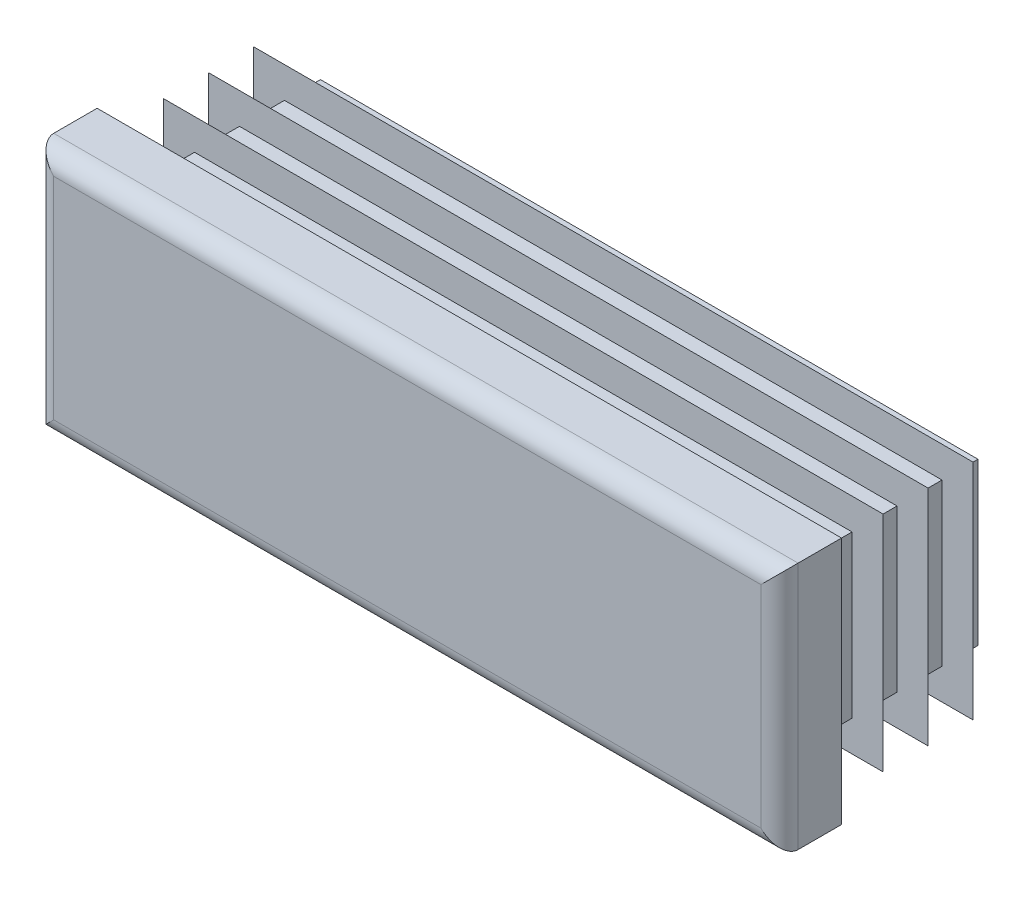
ISO-10303-21;
HEADER;
FILE_DESCRIPTION(('STEP AP214'),'2;1');
FILE_NAME('part.step','',(''),(''),'','','');
FILE_SCHEMA(('AUTOMOTIVE_DESIGN { 1 0 10303 214 1 1 1 1 }'));
ENDSEC;
DATA;
#1=APPLICATION_CONTEXT('core data for automotive mechanical design processes');
#2=APPLICATION_PROTOCOL_DEFINITION('international standard','automotive_design',2000,#1);
#3=PRODUCT_CONTEXT('',#1,'mechanical');
#4=PRODUCT('Part','Part','',(#3));
#5=PRODUCT_RELATED_PRODUCT_CATEGORY('part','',(#4));
#6=PRODUCT_DEFINITION_FORMATION('','',#4);
#7=PRODUCT_DEFINITION_CONTEXT('part definition',#1,'design');
#8=PRODUCT_DEFINITION('design','',#6,#7);
#9=PRODUCT_DEFINITION_SHAPE('','',#8);
#10=(LENGTH_UNIT() NAMED_UNIT(*) SI_UNIT(.MILLI.,.METRE.));
#11=(NAMED_UNIT(*) PLANE_ANGLE_UNIT() SI_UNIT($,.RADIAN.));
#12=(NAMED_UNIT(*) SI_UNIT($,.STERADIAN.) SOLID_ANGLE_UNIT());
#13=UNCERTAINTY_MEASURE_WITH_UNIT(LENGTH_MEASURE(1.E-05),#10,'distance_accuracy_value','');
#14=(GEOMETRIC_REPRESENTATION_CONTEXT(3) GLOBAL_UNCERTAINTY_ASSIGNED_CONTEXT((#13)) GLOBAL_UNIT_ASSIGNED_CONTEXT((#10,
#11,#12)) REPRESENTATION_CONTEXT('',''));
#15=CARTESIAN_POINT('',(0.,0.,0.));
#16=DIRECTION('',(0.,0.,1.));
#17=DIRECTION('',(1.,0.,0.));
#18=AXIS2_PLACEMENT_3D('',#15,#16,#17);
#19=CARTESIAN_POINT('',(28.5,-10.,5.));
#20=DIRECTION('',(0.,0.,-1.));
#21=DIRECTION('',(0.,1.,0.));
#22=AXIS2_PLACEMENT_3D('',#19,#20,#21);
#23=PLANE('',#22);
#24=DIRECTION('',(0.,1.,0.));
#25=VECTOR('',#24,1.);
#26=CARTESIAN_POINT('',(-28.5,-10.,5.));
#27=LINE('',#26,#25);
#28=CARTESIAN_POINT('',(-28.5,-8.5,5.));
#29=VERTEX_POINT('',#28);
#30=CARTESIAN_POINT('',(-28.5,8.5,5.));
#31=VERTEX_POINT('',#30);
#32=EDGE_CURVE('E310',#29,#31,#27,.T.);
#33=ORIENTED_EDGE('',*,*,#32,.F.);
#34=DIRECTION('',(-1.,0.,0.));
#35=VECTOR('',#34,1.);
#36=CARTESIAN_POINT('',(30.,-8.5,5.));
#37=LINE('',#36,#35);
#38=CARTESIAN_POINT('',(28.5,-8.5,5.));
#39=VERTEX_POINT('',#38);
#40=EDGE_CURVE('E482',#39,#29,#37,.T.);
#41=ORIENTED_EDGE('',*,*,#40,.F.);
#42=DIRECTION('',(0.,1.,0.));
#43=VECTOR('',#42,1.);
#44=CARTESIAN_POINT('',(28.5,-10.,5.));
#45=LINE('',#44,#43);
#46=CARTESIAN_POINT('',(28.5,8.5,5.));
#47=VERTEX_POINT('',#46);
#48=EDGE_CURVE('E305',#39,#47,#45,.T.);
#49=ORIENTED_EDGE('',*,*,#48,.T.);
#50=DIRECTION('',(-1.,0.,0.));
#51=VECTOR('',#50,1.);
#52=CARTESIAN_POINT('',(30.,8.5,5.));
#53=LINE('',#52,#51);
#54=EDGE_CURVE('E630',#47,#31,#53,.T.);
#55=ORIENTED_EDGE('',*,*,#54,.T.);
#56=EDGE_LOOP('',(#33,#41,#49,#55));
#57=FACE_BOUND('',#56,.T.);
#58=ADVANCED_FACE('F14',(#57),#23,.F.);
#59=CARTESIAN_POINT('',(-28.5,-10.,3.5));
#60=DIRECTION('',(0.,1.,0.));
#61=DIRECTION('',(-1.,0.,0.));
#62=AXIS2_PLACEMENT_3D('',#59,#60,#61);
#63=CYLINDRICAL_SURFACE('',#62,1.5);
#64=DIRECTION('',(0.,1.,0.));
#65=VECTOR('',#64,1.);
#66=CARTESIAN_POINT('',(-30.,-10.,3.5));
#67=LINE('',#66,#65);
#68=CARTESIAN_POINT('',(-30.,-10.,3.5));
#69=VERTEX_POINT('',#68);
#70=CARTESIAN_POINT('',(-30.,10.,3.5));
#71=VERTEX_POINT('',#70);
#72=EDGE_CURVE('E402',#69,#71,#67,.T.);
#73=ORIENTED_EDGE('',*,*,#72,.F.);
#74=CARTESIAN_POINT('',(-28.5,-8.5,3.5));
#75=DIRECTION('',(-0.707106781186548,0.707106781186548,0.));
#76=DIRECTION('',(0.707106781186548,0.707106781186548,0.));
#77=AXIS2_PLACEMENT_3D('',#74,#75,#76);
#78=ELLIPSE('',#77,2.12132034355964,1.5);
#79=EDGE_CURVE('E59',#69,#29,#78,.T.);
#80=ORIENTED_EDGE('',*,*,#79,.T.);
#81=ORIENTED_EDGE('',*,*,#32,.T.);
#82=CARTESIAN_POINT('',(-28.5,8.5,3.5));
#83=DIRECTION('',(0.707106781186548,0.707106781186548,0.));
#84=DIRECTION('',(-0.707106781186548,0.707106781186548,0.));
#85=AXIS2_PLACEMENT_3D('',#82,#83,#84);
#86=ELLIPSE('',#85,2.12132034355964,1.5);
#87=EDGE_CURVE('E306',#31,#71,#86,.F.);
#88=ORIENTED_EDGE('',*,*,#87,.T.);
#89=EDGE_LOOP('',(#73,#80,#81,#88));
#90=FACE_BOUND('',#89,.T.);
#91=ADVANCED_FACE('F16',(#90),#63,.T.);
#92=CARTESIAN_POINT('',(-30.,-10.,3.5));
#93=DIRECTION('',(1.,0.,0.));
#94=DIRECTION('',(0.,1.,0.));
#95=AXIS2_PLACEMENT_3D('',#92,#93,#94);
#96=PLANE('',#95);
#97=DIRECTION('',(0.,0.,-1.));
#98=VECTOR('',#97,1.);
#99=CARTESIAN_POINT('',(-30.,10.,3.5));
#100=LINE('',#99,#98);
#101=CARTESIAN_POINT('',(-30.,10.,0.));
#102=VERTEX_POINT('',#101);
#103=EDGE_CURVE('E615',#71,#102,#100,.T.);
#104=ORIENTED_EDGE('',*,*,#103,.T.);
#105=DIRECTION('',(0.,1.,0.));
#106=VECTOR('',#105,1.);
#107=CARTESIAN_POINT('',(-30.,-10.,0.));
#108=LINE('',#107,#106);
#109=CARTESIAN_POINT('',(-30.,-10.,0.));
#110=VERTEX_POINT('',#109);
#111=EDGE_CURVE('E400',#110,#102,#108,.T.);
#112=ORIENTED_EDGE('',*,*,#111,.F.);
#113=DIRECTION('',(0.,0.,-1.));
#114=VECTOR('',#113,1.);
#115=CARTESIAN_POINT('',(-30.,-10.,3.5));
#116=LINE('',#115,#114);
#117=EDGE_CURVE('E616',#69,#110,#116,.T.);
#118=ORIENTED_EDGE('',*,*,#117,.F.);
#119=ORIENTED_EDGE('',*,*,#72,.T.);
#120=EDGE_LOOP('',(#104,#112,#118,#119));
#121=FACE_BOUND('',#120,.T.);
#122=ADVANCED_FACE('F697',(#121),#96,.F.);
#123=CARTESIAN_POINT('',(-26.5,-10.,0.));
#124=DIRECTION('',(1.,0.,0.));
#125=DIRECTION('',(0.,1.,0.));
#126=AXIS2_PLACEMENT_3D('',#123,#124,#125);
#127=PLANE('',#126);
#128=DIRECTION('',(0.,1.,0.));
#129=VECTOR('',#128,1.);
#130=CARTESIAN_POINT('',(-26.5,-10.,0.));
#131=LINE('',#130,#129);
#132=CARTESIAN_POINT('',(-26.5,-6.5,0.));
#133=VERTEX_POINT('',#132);
#134=CARTESIAN_POINT('',(-26.5,6.5,0.));
#135=VERTEX_POINT('',#134);
#136=EDGE_CURVE('E397',#133,#135,#131,.T.);
#137=ORIENTED_EDGE('',*,*,#136,.T.);
#138=DIRECTION('',(0.,0.,-1.));
#139=VECTOR('',#138,1.);
#140=CARTESIAN_POINT('',(-26.5,6.5,0.));
#141=LINE('',#140,#139);
#142=CARTESIAN_POINT('',(-26.5,6.5,-0.725));
#143=VERTEX_POINT('',#142);
#144=EDGE_CURVE('E495',#135,#143,#141,.T.);
#145=ORIENTED_EDGE('',*,*,#144,.T.);
#146=DIRECTION('',(0.,1.,0.));
#147=VECTOR('',#146,1.);
#148=CARTESIAN_POINT('',(-26.5,-10.,-0.725));
#149=LINE('',#148,#147);
#150=CARTESIAN_POINT('',(-26.5,-6.5,-0.725));
#151=VERTEX_POINT('',#150);
#152=EDGE_CURVE('E394',#151,#143,#149,.T.);
#153=ORIENTED_EDGE('',*,*,#152,.F.);
#154=DIRECTION('',(0.,0.,1.));
#155=VECTOR('',#154,1.);
#156=CARTESIAN_POINT('',(-26.5,-6.5,0.));
#157=LINE('',#156,#155);
#158=EDGE_CURVE('E489',#151,#133,#157,.T.);
#159=ORIENTED_EDGE('',*,*,#158,.T.);
#160=EDGE_LOOP('',(#137,#145,#153,#159));
#161=FACE_BOUND('',#160,.T.);
#162=ADVANCED_FACE('F787',(#161),#127,.F.);
#163=CARTESIAN_POINT('',(-29.,-10.,-0.725));
#164=DIRECTION('',(0.34202014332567,0.,0.939692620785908));
#165=DIRECTION('',(-0.939692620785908,0.,0.34202014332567));
#166=AXIS2_PLACEMENT_3D('',#163,#164,#165);
#167=PLANE('',#166);
#168=DIRECTION('',(0.,1.,0.));
#169=VECTOR('',#168,1.);
#170=CARTESIAN_POINT('',(-29.,-10.,-0.725));
#171=LINE('',#170,#169);
#172=CARTESIAN_POINT('',(-29.,-9.,-0.725));
#173=VERTEX_POINT('',#172);
#174=CARTESIAN_POINT('',(-29.,9.,-0.725));
#175=VERTEX_POINT('',#174);
#176=EDGE_CURVE('E392',#173,#175,#171,.T.);
#177=ORIENTED_EDGE('',*,*,#176,.T.);
#178=DIRECTION('',(0.844349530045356,-0.438895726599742,-0.307318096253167));
#179=VECTOR('',#178,1.);
#180=CARTESIAN_POINT('',(-21.9589533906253,5.3400402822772,-3.28773138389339));
#181=LINE('',#180,#179);
#182=CARTESIAN_POINT('',(-26.5,7.70049158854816,-1.63492558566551));
#183=VERTEX_POINT('',#182);
#184=EDGE_CURVE('E519',#175,#183,#181,.T.);
#185=ORIENTED_EDGE('',*,*,#184,.T.);
#186=DIRECTION('',(0.,1.,0.));
#187=VECTOR('',#186,1.);
#188=CARTESIAN_POINT('',(-26.5,-10.,-1.63492558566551));
#189=LINE('',#188,#187);
#190=CARTESIAN_POINT('',(-26.5,-7.70049158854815,-1.63492558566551));
#191=VERTEX_POINT('',#190);
#192=EDGE_CURVE('E389',#191,#183,#189,.T.);
#193=ORIENTED_EDGE('',*,*,#192,.F.);
#194=DIRECTION('',(-0.844349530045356,-0.438895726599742,0.307318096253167));
#195=VECTOR('',#194,1.);
#196=CARTESIAN_POINT('',(-29.3705814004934,-9.19262945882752,-0.590119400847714));
#197=LINE('',#196,#195);
#198=EDGE_CURVE('E507',#191,#173,#197,.T.);
#199=ORIENTED_EDGE('',*,*,#198,.T.);
#200=EDGE_LOOP('',(#177,#185,#193,#199));
#201=FACE_BOUND('',#200,.T.);
#202=ADVANCED_FACE('F783',(#201),#167,.F.);
#203=CARTESIAN_POINT('',(-26.5,-10.,-1.63492558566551));
#204=DIRECTION('',(1.,0.,0.));
#205=DIRECTION('',(0.,1.,0.));
#206=AXIS2_PLACEMENT_3D('',#203,#204,#205);
#207=PLANE('',#206);
#208=ORIENTED_EDGE('',*,*,#192,.T.);
#209=DIRECTION('',(0.,-0.819152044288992,-0.573576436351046));
#210=VECTOR('',#209,1.);
#211=CARTESIAN_POINT('',(-26.5,-4.17671654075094,-9.95143625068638));
#212=LINE('',#211,#210);
#213=CARTESIAN_POINT('',(-26.5,6.5,-2.47551884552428));
#214=VERTEX_POINT('',#213);
#215=EDGE_CURVE('E516',#183,#214,#212,.T.);
#216=ORIENTED_EDGE('',*,*,#215,.T.);
#217=DIRECTION('',(0.,0.,-1.));
#218=VECTOR('',#217,1.);
#219=CARTESIAN_POINT('',(-26.5,6.5,-1.63492558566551));
#220=LINE('',#219,#218);
#221=CARTESIAN_POINT('',(-26.5,6.5,-4.35));
#222=VERTEX_POINT('',#221);
#223=EDGE_CURVE('E525',#214,#222,#220,.T.);
#224=ORIENTED_EDGE('',*,*,#223,.T.);
#225=DIRECTION('',(0.,1.,0.));
#226=VECTOR('',#225,1.);
#227=CARTESIAN_POINT('',(-26.5,-10.,-4.35));
#228=LINE('',#227,#226);
#229=CARTESIAN_POINT('',(-26.5,-6.5,-4.35));
#230=VERTEX_POINT('',#229);
#231=EDGE_CURVE('E386',#230,#222,#228,.T.);
#232=ORIENTED_EDGE('',*,*,#231,.F.);
#233=DIRECTION('',(0.,0.,1.));
#234=VECTOR('',#233,1.);
#235=CARTESIAN_POINT('',(-26.5,-6.5,-1.63492558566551));
#236=LINE('',#235,#234);
#237=CARTESIAN_POINT('',(-26.5,-6.5,-2.47551884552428));
#238=VERTEX_POINT('',#237);
#239=EDGE_CURVE('E522',#230,#238,#236,.T.);
#240=ORIENTED_EDGE('',*,*,#239,.T.);
#241=DIRECTION('',(0.,-0.819152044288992,0.573576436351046));
#242=VECTOR('',#241,1.);
#243=CARTESIAN_POINT('',(-26.5,-9.24348489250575,-0.554510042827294));
#244=LINE('',#243,#242);
#245=EDGE_CURVE('E504',#238,#191,#244,.T.);
#246=ORIENTED_EDGE('',*,*,#245,.T.);
#247=EDGE_LOOP('',(#208,#216,#224,#232,#240,#246));
#248=FACE_BOUND('',#247,.T.);
#249=ADVANCED_FACE('F779',(#248),#207,.F.);
#250=CARTESIAN_POINT('',(-29.,-10.,-4.35));
#251=DIRECTION('',(0.34202014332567,0.,0.939692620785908));
#252=DIRECTION('',(-0.939692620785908,0.,0.34202014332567));
#253=AXIS2_PLACEMENT_3D('',#250,#251,#252);
#254=PLANE('',#253);
#255=DIRECTION('',(0.,1.,0.));
#256=VECTOR('',#255,1.);
#257=CARTESIAN_POINT('',(-29.,-10.,-4.35));
#258=LINE('',#257,#256);
#259=CARTESIAN_POINT('',(-29.,-9.,-4.35));
#260=VERTEX_POINT('',#259);
#261=CARTESIAN_POINT('',(-29.,9.,-4.35));
#262=VERTEX_POINT('',#261);
#263=EDGE_CURVE('E384',#260,#262,#258,.T.);
#264=ORIENTED_EDGE('',*,*,#263,.T.);
#265=DIRECTION('',(0.844349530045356,-0.438895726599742,-0.307318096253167));
#266=VECTOR('',#265,1.);
#267=CARTESIAN_POINT('',(-21.9589533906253,5.3400402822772,-6.91273138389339));
#268=LINE('',#267,#266);
#269=CARTESIAN_POINT('',(-26.5,7.70049158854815,-5.25992558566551));
#270=VERTEX_POINT('',#269);
#271=EDGE_CURVE('E549',#262,#270,#268,.T.);
#272=ORIENTED_EDGE('',*,*,#271,.T.);
#273=DIRECTION('',(0.,1.,0.));
#274=VECTOR('',#273,1.);
#275=CARTESIAN_POINT('',(-26.5,-10.,-5.25992558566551));
#276=LINE('',#275,#274);
#277=CARTESIAN_POINT('',(-26.5,-7.70049158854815,-5.25992558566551));
#278=VERTEX_POINT('',#277);
#279=EDGE_CURVE('E381',#278,#270,#276,.T.);
#280=ORIENTED_EDGE('',*,*,#279,.F.);
#281=DIRECTION('',(-0.844349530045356,-0.438895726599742,0.307318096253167));
#282=VECTOR('',#281,1.);
#283=CARTESIAN_POINT('',(-29.3705814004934,-9.19262945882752,-4.21511940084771));
#284=LINE('',#283,#282);
#285=EDGE_CURVE('E537',#278,#260,#284,.T.);
#286=ORIENTED_EDGE('',*,*,#285,.T.);
#287=EDGE_LOOP('',(#264,#272,#280,#286));
#288=FACE_BOUND('',#287,.T.);
#289=ADVANCED_FACE('F775',(#288),#254,.F.);
#290=CARTESIAN_POINT('',(-26.5,-10.,-5.25992558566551));
#291=DIRECTION('',(1.,0.,0.));
#292=DIRECTION('',(0.,1.,0.));
#293=AXIS2_PLACEMENT_3D('',#290,#291,#292);
#294=PLANE('',#293);
#295=ORIENTED_EDGE('',*,*,#279,.T.);
#296=DIRECTION('',(0.,-0.819152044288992,-0.573576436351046));
#297=VECTOR('',#296,1.);
#298=CARTESIAN_POINT('',(-26.5,-4.17671654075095,-13.5764362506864));
#299=LINE('',#298,#297);
#300=CARTESIAN_POINT('',(-26.5,6.5,-6.10051884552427));
#301=VERTEX_POINT('',#300);
#302=EDGE_CURVE('E546',#270,#301,#299,.T.);
#303=ORIENTED_EDGE('',*,*,#302,.T.);
#304=DIRECTION('',(0.,0.,-1.));
#305=VECTOR('',#304,1.);
#306=CARTESIAN_POINT('',(-26.5,6.5,-5.25992558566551));
#307=LINE('',#306,#305);
#308=CARTESIAN_POINT('',(-26.5,6.5,-7.975));
#309=VERTEX_POINT('',#308);
#310=EDGE_CURVE('E555',#301,#309,#307,.T.);
#311=ORIENTED_EDGE('',*,*,#310,.T.);
#312=DIRECTION('',(0.,1.,0.));
#313=VECTOR('',#312,1.);
#314=CARTESIAN_POINT('',(-26.5,-10.,-7.975));
#315=LINE('',#314,#313);
#316=CARTESIAN_POINT('',(-26.5,-6.5,-7.975));
#317=VERTEX_POINT('',#316);
#318=EDGE_CURVE('E378',#317,#309,#315,.T.);
#319=ORIENTED_EDGE('',*,*,#318,.F.);
#320=DIRECTION('',(0.,0.,1.));
#321=VECTOR('',#320,1.);
#322=CARTESIAN_POINT('',(-26.5,-6.5,-5.25992558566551));
#323=LINE('',#322,#321);
#324=CARTESIAN_POINT('',(-26.5,-6.5,-6.10051884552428));
#325=VERTEX_POINT('',#324);
#326=EDGE_CURVE('E552',#317,#325,#323,.T.);
#327=ORIENTED_EDGE('',*,*,#326,.T.);
#328=DIRECTION('',(0.,-0.819152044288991,0.573576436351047));
#329=VECTOR('',#328,1.);
#330=CARTESIAN_POINT('',(-26.5,-9.24348489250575,-4.17951004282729));
#331=LINE('',#330,#329);
#332=EDGE_CURVE('E534',#325,#278,#331,.T.);
#333=ORIENTED_EDGE('',*,*,#332,.T.);
#334=EDGE_LOOP('',(#295,#303,#311,#319,#327,#333));
#335=FACE_BOUND('',#334,.T.);
#336=ADVANCED_FACE('F771',(#335),#294,.F.);
#337=CARTESIAN_POINT('',(-29.,-10.,-7.975));
#338=DIRECTION('',(0.342020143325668,0.,0.939692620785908));
#339=DIRECTION('',(-0.939692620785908,0.,0.342020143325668));
#340=AXIS2_PLACEMENT_3D('',#337,#338,#339);
#341=PLANE('',#340);
#342=DIRECTION('',(0.,1.,0.));
#343=VECTOR('',#342,1.);
#344=CARTESIAN_POINT('',(-29.,-10.,-7.975));
#345=LINE('',#344,#343);
#346=CARTESIAN_POINT('',(-29.,-9.,-7.975));
#347=VERTEX_POINT('',#346);
#348=CARTESIAN_POINT('',(-29.,9.,-7.975));
#349=VERTEX_POINT('',#348);
#350=EDGE_CURVE('E376',#347,#349,#345,.T.);
#351=ORIENTED_EDGE('',*,*,#350,.T.);
#352=DIRECTION('',(0.844349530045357,-0.438895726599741,-0.307318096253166));
#353=VECTOR('',#352,1.);
#354=CARTESIAN_POINT('',(-21.9589533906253,5.34004028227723,-10.5377313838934));
#355=LINE('',#354,#353);
#356=CARTESIAN_POINT('',(-26.5,7.70049158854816,-8.88492558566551));
#357=VERTEX_POINT('',#356);
#358=EDGE_CURVE('E579',#349,#357,#355,.T.);
#359=ORIENTED_EDGE('',*,*,#358,.T.);
#360=DIRECTION('',(0.,1.,0.));
#361=VECTOR('',#360,1.);
#362=CARTESIAN_POINT('',(-26.5,-10.,-8.88492558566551));
#363=LINE('',#362,#361);
#364=CARTESIAN_POINT('',(-26.5,-7.70049158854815,-8.88492558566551));
#365=VERTEX_POINT('',#364);
#366=EDGE_CURVE('E373',#365,#357,#363,.T.);
#367=ORIENTED_EDGE('',*,*,#366,.F.);
#368=DIRECTION('',(-0.844349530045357,-0.438895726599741,0.307318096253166));
#369=VECTOR('',#368,1.);
#370=CARTESIAN_POINT('',(-29.3705814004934,-9.19262945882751,-7.84011940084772));
#371=LINE('',#370,#369);
#372=EDGE_CURVE('E567',#365,#347,#371,.T.);
#373=ORIENTED_EDGE('',*,*,#372,.T.);
#374=EDGE_LOOP('',(#351,#359,#367,#373));
#375=FACE_BOUND('',#374,.T.);
#376=ADVANCED_FACE('F767',(#375),#341,.F.);
#377=CARTESIAN_POINT('',(-26.5,-10.,-8.88492558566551));
#378=DIRECTION('',(1.,0.,0.));
#379=DIRECTION('',(0.,1.,0.));
#380=AXIS2_PLACEMENT_3D('',#377,#378,#379);
#381=PLANE('',#380);
#382=ORIENTED_EDGE('',*,*,#366,.T.);
#383=DIRECTION('',(0.,-0.819152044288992,-0.573576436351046));
#384=VECTOR('',#383,1.);
#385=CARTESIAN_POINT('',(-26.5,-4.17671654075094,-17.2014362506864));
#386=LINE('',#385,#384);
#387=CARTESIAN_POINT('',(-26.5,6.5,-9.72551884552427));
#388=VERTEX_POINT('',#387);
#389=EDGE_CURVE('E576',#357,#388,#386,.T.);
#390=ORIENTED_EDGE('',*,*,#389,.T.);
#391=DIRECTION('',(0.,0.,-1.));
#392=VECTOR('',#391,1.);
#393=CARTESIAN_POINT('',(-26.5,6.5,-8.88492558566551));
#394=LINE('',#393,#392);
#395=CARTESIAN_POINT('',(-26.5,6.5,-11.6));
#396=VERTEX_POINT('',#395);
#397=EDGE_CURVE('E585',#388,#396,#394,.T.);
#398=ORIENTED_EDGE('',*,*,#397,.T.);
#399=DIRECTION('',(0.,1.,0.));
#400=VECTOR('',#399,1.);
#401=CARTESIAN_POINT('',(-26.5,-10.,-11.6));
#402=LINE('',#401,#400);
#403=CARTESIAN_POINT('',(-26.5,-6.5,-11.6));
#404=VERTEX_POINT('',#403);
#405=EDGE_CURVE('E370',#404,#396,#402,.T.);
#406=ORIENTED_EDGE('',*,*,#405,.F.);
#407=DIRECTION('',(0.,0.,1.));
#408=VECTOR('',#407,1.);
#409=CARTESIAN_POINT('',(-26.5,-6.5,-8.88492558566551));
#410=LINE('',#409,#408);
#411=CARTESIAN_POINT('',(-26.5,-6.5,-9.72551884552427));
#412=VERTEX_POINT('',#411);
#413=EDGE_CURVE('E582',#404,#412,#410,.T.);
#414=ORIENTED_EDGE('',*,*,#413,.T.);
#415=DIRECTION('',(0.,-0.819152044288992,0.573576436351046));
#416=VECTOR('',#415,1.);
#417=CARTESIAN_POINT('',(-26.5,-9.24348489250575,-7.80451004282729));
#418=LINE('',#417,#416);
#419=EDGE_CURVE('E564',#412,#365,#418,.T.);
#420=ORIENTED_EDGE('',*,*,#419,.T.);
#421=EDGE_LOOP('',(#382,#390,#398,#406,#414,#420));
#422=FACE_BOUND('',#421,.T.);
#423=ADVANCED_FACE('F764',(#422),#381,.F.);
#424=CARTESIAN_POINT('',(-29.,-10.,-11.6));
#425=DIRECTION('',(0.342020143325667,0.,0.939692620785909));
#426=DIRECTION('',(-0.939692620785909,0.,0.342020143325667));
#427=AXIS2_PLACEMENT_3D('',#424,#425,#426);
#428=PLANE('',#427);
#429=DIRECTION('',(0.,1.,0.));
#430=VECTOR('',#429,1.);
#431=CARTESIAN_POINT('',(-29.,-10.,-11.6));
#432=LINE('',#431,#430);
#433=CARTESIAN_POINT('',(-29.,-9.,-11.6));
#434=VERTEX_POINT('',#433);
#435=CARTESIAN_POINT('',(-29.,9.,-11.6));
#436=VERTEX_POINT('',#435);
#437=EDGE_CURVE('E368',#434,#436,#432,.T.);
#438=ORIENTED_EDGE('',*,*,#437,.T.);
#439=DIRECTION('',(0.844349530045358,-0.438895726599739,-0.307318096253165));
#440=VECTOR('',#439,1.);
#441=CARTESIAN_POINT('',(-21.9589533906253,5.34004028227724,-14.1627313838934));
#442=LINE('',#441,#440);
#443=CARTESIAN_POINT('',(-26.5,7.70049158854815,-12.5099255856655));
#444=VERTEX_POINT('',#443);
#445=EDGE_CURVE('E607',#436,#444,#442,.T.);
#446=ORIENTED_EDGE('',*,*,#445,.T.);
#447=DIRECTION('',(0.,1.,0.));
#448=VECTOR('',#447,1.);
#449=CARTESIAN_POINT('',(-26.5,-10.,-12.5099255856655));
#450=LINE('',#449,#448);
#451=CARTESIAN_POINT('',(-26.5,-7.70049158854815,-12.5099255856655));
#452=VERTEX_POINT('',#451);
#453=EDGE_CURVE('E365',#452,#444,#450,.T.);
#454=ORIENTED_EDGE('',*,*,#453,.F.);
#455=DIRECTION('',(-0.844349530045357,-0.43889572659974,0.307318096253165));
#456=VECTOR('',#455,1.);
#457=CARTESIAN_POINT('',(-29.3705814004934,-9.19262945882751,-11.4651194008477));
#458=LINE('',#457,#456);
#459=EDGE_CURVE('E595',#452,#434,#458,.T.);
#460=ORIENTED_EDGE('',*,*,#459,.T.);
#461=EDGE_LOOP('',(#438,#446,#454,#460));
#462=FACE_BOUND('',#461,.T.);
#463=ADVANCED_FACE('F675',(#462),#428,.F.);
#464=CARTESIAN_POINT('',(-26.5,-10.,-12.5099255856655));
#465=DIRECTION('',(1.,0.,0.));
#466=DIRECTION('',(0.,1.,0.));
#467=AXIS2_PLACEMENT_3D('',#464,#465,#466);
#468=PLANE('',#467);
#469=ORIENTED_EDGE('',*,*,#453,.T.);
#470=DIRECTION('',(0.,-0.819152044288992,-0.573576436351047));
#471=VECTOR('',#470,1.);
#472=CARTESIAN_POINT('',(-26.5,-4.17671654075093,-20.8264362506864));
#473=LINE('',#472,#471);
#474=CARTESIAN_POINT('',(-26.5,6.5,-13.3505188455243));
#475=VERTEX_POINT('',#474);
#476=EDGE_CURVE('E604',#444,#475,#473,.T.);
#477=ORIENTED_EDGE('',*,*,#476,.T.);
#478=DIRECTION('',(0.,0.,-1.));
#479=VECTOR('',#478,1.);
#480=CARTESIAN_POINT('',(-26.5,6.5,-12.5099255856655));
#481=LINE('',#480,#479);
#482=CARTESIAN_POINT('',(-26.5,6.5,-14.5));
#483=VERTEX_POINT('',#482);
#484=EDGE_CURVE('E613',#475,#483,#481,.T.);
#485=ORIENTED_EDGE('',*,*,#484,.T.);
#486=DIRECTION('',(0.,1.,0.));
#487=VECTOR('',#486,1.);
#488=CARTESIAN_POINT('',(-26.5,-10.,-14.5));
#489=LINE('',#488,#487);
#490=CARTESIAN_POINT('',(-26.5,-6.5,-14.5));
#491=VERTEX_POINT('',#490);
#492=EDGE_CURVE('E362',#491,#483,#489,.T.);
#493=ORIENTED_EDGE('',*,*,#492,.F.);
#494=DIRECTION('',(0.,0.,1.));
#495=VECTOR('',#494,1.);
#496=CARTESIAN_POINT('',(-26.5,-6.5,-12.5099255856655));
#497=LINE('',#496,#495);
#498=CARTESIAN_POINT('',(-26.5,-6.5,-13.3505188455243));
#499=VERTEX_POINT('',#498);
#500=EDGE_CURVE('E610',#491,#499,#497,.T.);
#501=ORIENTED_EDGE('',*,*,#500,.T.);
#502=DIRECTION('',(0.,-0.819152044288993,0.573576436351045));
#503=VECTOR('',#502,1.);
#504=CARTESIAN_POINT('',(-26.5,-9.24348489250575,-11.4295100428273));
#505=LINE('',#504,#503);
#506=EDGE_CURVE('E592',#499,#452,#505,.T.);
#507=ORIENTED_EDGE('',*,*,#506,.T.);
#508=EDGE_LOOP('',(#469,#477,#485,#493,#501,#507));
#509=FACE_BOUND('',#508,.T.);
#510=ADVANCED_FACE('F677',(#509),#468,.F.);
#511=CARTESIAN_POINT('',(-26.5,-10.,-14.5));
#512=DIRECTION('',(0.,0.,1.));
#513=DIRECTION('',(0.,-1.,0.));
#514=AXIS2_PLACEMENT_3D('',#511,#512,#513);
#515=PLANE('',#514);
#516=ORIENTED_EDGE('',*,*,#492,.T.);
#517=DIRECTION('',(-1.,0.,0.));
#518=VECTOR('',#517,1.);
#519=CARTESIAN_POINT('',(30.,6.5,-14.5));
#520=LINE('',#519,#518);
#521=CARTESIAN_POINT('',(26.5,6.5,-14.5));
#522=VERTEX_POINT('',#521);
#523=EDGE_CURVE('E438',#522,#483,#520,.T.);
#524=ORIENTED_EDGE('',*,*,#523,.F.);
#525=DIRECTION('',(0.,1.,0.));
#526=VECTOR('',#525,1.);
#527=CARTESIAN_POINT('',(26.5,-10.,-14.5));
#528=LINE('',#527,#526);
#529=CARTESIAN_POINT('',(26.5,-6.5,-14.5));
#530=VERTEX_POINT('',#529);
#531=EDGE_CURVE('E359',#530,#522,#528,.T.);
#532=ORIENTED_EDGE('',*,*,#531,.F.);
#533=DIRECTION('',(-1.,0.,0.));
#534=VECTOR('',#533,1.);
#535=CARTESIAN_POINT('',(30.,-6.5,-14.5));
#536=LINE('',#535,#534);
#537=EDGE_CURVE('E436',#530,#491,#536,.T.);
#538=ORIENTED_EDGE('',*,*,#537,.T.);
#539=EDGE_LOOP('',(#516,#524,#532,#538));
#540=FACE_BOUND('',#539,.T.);
#541=ADVANCED_FACE('F435',(#540),#515,.F.);
#542=CARTESIAN_POINT('',(26.5,-10.,-14.5));
#543=DIRECTION('',(-1.,0.,0.));
#544=DIRECTION('',(0.,-1.,0.));
#545=AXIS2_PLACEMENT_3D('',#542,#543,#544);
#546=PLANE('',#545);
#547=DIRECTION('',(0.,0.,1.));
#548=VECTOR('',#547,1.);
#549=CARTESIAN_POINT('',(26.5,6.5,-14.5));
#550=LINE('',#549,#548);
#551=CARTESIAN_POINT('',(26.5,6.5,-13.3505188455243));
#552=VERTEX_POINT('',#551);
#553=EDGE_CURVE('E9',#522,#552,#550,.T.);
#554=ORIENTED_EDGE('',*,*,#553,.T.);
#555=DIRECTION('',(0.,0.819152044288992,0.573576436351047));
#556=VECTOR('',#555,1.);
#557=CARTESIAN_POINT('',(26.5,-5.11174566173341,-21.4811506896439));
#558=LINE('',#557,#556);
#559=CARTESIAN_POINT('',(26.5,7.70049158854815,-12.5099255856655));
#560=VERTEX_POINT('',#559);
#561=EDGE_CURVE('E601',#552,#560,#558,.T.);
#562=ORIENTED_EDGE('',*,*,#561,.T.);
#563=DIRECTION('',(0.,1.,0.));
#564=VECTOR('',#563,1.);
#565=CARTESIAN_POINT('',(26.5,-10.,-12.5099255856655));
#566=LINE('',#565,#564);
#567=CARTESIAN_POINT('',(26.5,-7.70049158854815,-12.5099255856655));
#568=VERTEX_POINT('',#567);
#569=EDGE_CURVE('E356',#568,#560,#566,.T.);
#570=ORIENTED_EDGE('',*,*,#569,.F.);
#571=DIRECTION('',(0.,0.819152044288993,-0.573576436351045));
#572=VECTOR('',#571,1.);
#573=CARTESIAN_POINT('',(26.5,-8.30845577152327,-12.0842244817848));
#574=LINE('',#573,#572);
#575=CARTESIAN_POINT('',(26.5,-6.5,-13.3505188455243));
#576=VERTEX_POINT('',#575);
#577=EDGE_CURVE('E428',#568,#576,#574,.T.);
#578=ORIENTED_EDGE('',*,*,#577,.T.);
#579=DIRECTION('',(0.,0.,-1.));
#580=VECTOR('',#579,1.);
#581=CARTESIAN_POINT('',(26.5,-6.5,-14.5));
#582=LINE('',#581,#580);
#583=EDGE_CURVE('E23',#576,#530,#582,.T.);
#584=ORIENTED_EDGE('',*,*,#583,.T.);
#585=ORIENTED_EDGE('',*,*,#531,.T.);
#586=EDGE_LOOP('',(#554,#562,#570,#578,#584,#585));
#587=FACE_BOUND('',#586,.T.);
#588=ADVANCED_FACE('F426',(#587),#546,.F.);
#589=CARTESIAN_POINT('',(26.5,-10.,-12.5099255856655));
#590=DIRECTION('',(-0.342020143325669,0.,0.939692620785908));
#591=DIRECTION('',(-0.939692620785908,0.,-0.342020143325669));
#592=AXIS2_PLACEMENT_3D('',#589,#590,#591);
#593=PLANE('',#592);
#594=ORIENTED_EDGE('',*,*,#569,.T.);
#595=DIRECTION('',(0.844349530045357,0.43889572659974,0.307318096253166));
#596=VECTOR('',#595,1.);
#597=CARTESIAN_POINT('',(19.940527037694,4.29085547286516,-14.8973784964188));
#598=LINE('',#597,#596);
#599=CARTESIAN_POINT('',(29.,9.,-11.6));
#600=VERTEX_POINT('',#599);
#601=EDGE_CURVE('E598',#560,#600,#598,.T.);
#602=ORIENTED_EDGE('',*,*,#601,.T.);
#603=DIRECTION('',(0.,1.,0.));
#604=VECTOR('',#603,1.);
#605=CARTESIAN_POINT('',(29.,-10.,-11.6));
#606=LINE('',#605,#604);
#607=CARTESIAN_POINT('',(29.,-9.,-11.6));
#608=VERTEX_POINT('',#607);
#609=EDGE_CURVE('E353',#608,#600,#606,.T.);
#610=ORIENTED_EDGE('',*,*,#609,.F.);
#611=DIRECTION('',(-0.844349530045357,0.438895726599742,-0.307318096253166));
#612=VECTOR('',#611,1.);
#613=CARTESIAN_POINT('',(27.3521550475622,-8.14344464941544,-12.1997665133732));
#614=LINE('',#613,#612);
#615=EDGE_CURVE('E588',#608,#568,#614,.T.);
#616=ORIENTED_EDGE('',*,*,#615,.T.);
#617=EDGE_LOOP('',(#594,#602,#610,#616));
#618=FACE_BOUND('',#617,.T.);
#619=ADVANCED_FACE('F752',(#618),#593,.F.);
#620=CARTESIAN_POINT('',(29.,-10.,-11.6));
#621=DIRECTION('',(0.,0.,-1.));
#622=DIRECTION('',(0.,1.,0.));
#623=AXIS2_PLACEMENT_3D('',#620,#621,#622);
#624=PLANE('',#623);
#625=ORIENTED_EDGE('',*,*,#609,.T.);
#626=DIRECTION('',(-1.,0.,0.));
#627=VECTOR('',#626,1.);
#628=CARTESIAN_POINT('',(30.,9.,-11.6));
#629=LINE('',#628,#627);
#630=EDGE_CURVE('E444',#600,#436,#629,.T.);
#631=ORIENTED_EDGE('',*,*,#630,.T.);
#632=ORIENTED_EDGE('',*,*,#437,.F.);
#633=DIRECTION('',(-1.,0.,0.));
#634=VECTOR('',#633,1.);
#635=CARTESIAN_POINT('',(30.,-9.,-11.6));
#636=LINE('',#635,#634);
#637=EDGE_CURVE('E451',#608,#434,#636,.T.);
#638=ORIENTED_EDGE('',*,*,#637,.F.);
#639=EDGE_LOOP('',(#625,#631,#632,#638));
#640=FACE_BOUND('',#639,.T.);
#641=ORIENTED_EDGE('',*,*,#405,.T.);
#642=DIRECTION('',(-1.,0.,0.));
#643=VECTOR('',#642,1.);
#644=CARTESIAN_POINT('',(30.,6.5,-11.6));
#645=LINE('',#644,#643);
#646=CARTESIAN_POINT('',(26.5,6.5,-11.6));
#647=VERTEX_POINT('',#646);
#648=EDGE_CURVE('E663',#647,#396,#645,.T.);
#649=ORIENTED_EDGE('',*,*,#648,.F.);
#650=DIRECTION('',(0.,1.,0.));
#651=VECTOR('',#650,1.);
#652=CARTESIAN_POINT('',(26.5,-10.,-11.6));
#653=LINE('',#652,#651);
#654=CARTESIAN_POINT('',(26.5,-6.5,-11.6));
#655=VERTEX_POINT('',#654);
#656=EDGE_CURVE('E350',#655,#647,#653,.T.);
#657=ORIENTED_EDGE('',*,*,#656,.F.);
#658=DIRECTION('',(-1.,0.,0.));
#659=VECTOR('',#658,1.);
#660=CARTESIAN_POINT('',(30.,-6.5,-11.6));
#661=LINE('',#660,#659);
#662=EDGE_CURVE('E453',#655,#404,#661,.T.);
#663=ORIENTED_EDGE('',*,*,#662,.T.);
#664=EDGE_LOOP('',(#641,#649,#657,#663));
#665=FACE_BOUND('',#664,.T.);
#666=ADVANCED_FACE('F667',(#640,#665),#624,.F.);
#667=CARTESIAN_POINT('',(26.5,-10.,-11.6));
#668=DIRECTION('',(-1.,0.,0.));
#669=DIRECTION('',(0.,-1.,0.));
#670=AXIS2_PLACEMENT_3D('',#667,#668,#669);
#671=PLANE('',#670);
#672=DIRECTION('',(0.,0.,1.));
#673=VECTOR('',#672,1.);
#674=CARTESIAN_POINT('',(26.5,6.5,-11.6));
#675=LINE('',#674,#673);
#676=CARTESIAN_POINT('',(26.5,6.5,-9.72551884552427));
#677=VERTEX_POINT('',#676);
#678=EDGE_CURVE('E420',#647,#677,#675,.T.);
#679=ORIENTED_EDGE('',*,*,#678,.T.);
#680=DIRECTION('',(0.,0.819152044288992,0.573576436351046));
#681=VECTOR('',#680,1.);
#682=CARTESIAN_POINT('',(26.5,-5.45238423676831,-18.0946683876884));
#683=LINE('',#682,#681);
#684=CARTESIAN_POINT('',(26.5,7.70049158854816,-8.88492558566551));
#685=VERTEX_POINT('',#684);
#686=EDGE_CURVE('E573',#677,#685,#683,.T.);
#687=ORIENTED_EDGE('',*,*,#686,.T.);
#688=DIRECTION('',(0.,1.,0.));
#689=VECTOR('',#688,1.);
#690=CARTESIAN_POINT('',(26.5,-10.,-8.88492558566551));
#691=LINE('',#690,#689);
#692=CARTESIAN_POINT('',(26.5,-7.70049158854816,-8.88492558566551));
#693=VERTEX_POINT('',#692);
#694=EDGE_CURVE('E347',#693,#685,#691,.T.);
#695=ORIENTED_EDGE('',*,*,#694,.F.);
#696=DIRECTION('',(0.,0.819152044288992,-0.573576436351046));
#697=VECTOR('',#696,1.);
#698=CARTESIAN_POINT('',(26.5,-7.96781719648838,-8.69774217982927));
#699=LINE('',#698,#697);
#700=CARTESIAN_POINT('',(26.5,-6.5,-9.72551884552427));
#701=VERTEX_POINT('',#700);
#702=EDGE_CURVE('E561',#693,#701,#699,.T.);
#703=ORIENTED_EDGE('',*,*,#702,.T.);
#704=DIRECTION('',(0.,0.,-1.));
#705=VECTOR('',#704,1.);
#706=CARTESIAN_POINT('',(26.5,-6.5,-11.6));
#707=LINE('',#706,#705);
#708=EDGE_CURVE('E417',#701,#655,#707,.T.);
#709=ORIENTED_EDGE('',*,*,#708,.T.);
#710=ORIENTED_EDGE('',*,*,#656,.T.);
#711=EDGE_LOOP('',(#679,#687,#695,#703,#709,#710));
#712=FACE_BOUND('',#711,.T.);
#713=ADVANCED_FACE('F745',(#712),#671,.F.);
#714=CARTESIAN_POINT('',(26.5,-10.,-8.88492558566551));
#715=DIRECTION('',(-0.342020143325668,0.,0.939692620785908));
#716=DIRECTION('',(-0.939692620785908,0.,-0.342020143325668));
#717=AXIS2_PLACEMENT_3D('',#714,#715,#716);
#718=PLANE('',#717);
#719=ORIENTED_EDGE('',*,*,#694,.T.);
#720=DIRECTION('',(0.844349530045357,0.438895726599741,0.307318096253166));
#721=VECTOR('',#720,1.);
#722=CARTESIAN_POINT('',(19.940527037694,4.29085547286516,-11.2723784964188));
#723=LINE('',#722,#721);
#724=CARTESIAN_POINT('',(29.,9.,-7.975));
#725=VERTEX_POINT('',#724);
#726=EDGE_CURVE('E570',#685,#725,#723,.T.);
#727=ORIENTED_EDGE('',*,*,#726,.T.);
#728=DIRECTION('',(0.,1.,0.));
#729=VECTOR('',#728,1.);
#730=CARTESIAN_POINT('',(29.,-10.,-7.975));
#731=LINE('',#730,#729);
#732=CARTESIAN_POINT('',(29.,-9.,-7.975));
#733=VERTEX_POINT('',#732);
#734=EDGE_CURVE('E344',#733,#725,#731,.T.);
#735=ORIENTED_EDGE('',*,*,#734,.F.);
#736=DIRECTION('',(-0.844349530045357,0.438895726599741,-0.307318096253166));
#737=VECTOR('',#736,1.);
#738=CARTESIAN_POINT('',(27.3521550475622,-8.14344464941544,-8.57476651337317));
#739=LINE('',#738,#737);
#740=EDGE_CURVE('E558',#733,#693,#739,.T.);
#741=ORIENTED_EDGE('',*,*,#740,.T.);
#742=EDGE_LOOP('',(#719,#727,#735,#741));
#743=FACE_BOUND('',#742,.T.);
#744=ADVANCED_FACE('F741',(#743),#718,.F.);
#745=CARTESIAN_POINT('',(29.,-10.,-7.975));
#746=DIRECTION('',(0.,0.,-1.));
#747=DIRECTION('',(0.,1.,0.));
#748=AXIS2_PLACEMENT_3D('',#745,#746,#747);
#749=PLANE('',#748);
#750=ORIENTED_EDGE('',*,*,#734,.T.);
#751=DIRECTION('',(-1.,0.,0.));
#752=VECTOR('',#751,1.);
#753=CARTESIAN_POINT('',(30.,9.,-7.975));
#754=LINE('',#753,#752);
#755=EDGE_CURVE('E657',#725,#349,#754,.T.);
#756=ORIENTED_EDGE('',*,*,#755,.T.);
#757=ORIENTED_EDGE('',*,*,#350,.F.);
#758=DIRECTION('',(-1.,0.,0.));
#759=VECTOR('',#758,1.);
#760=CARTESIAN_POINT('',(30.,-9.,-7.975));
#761=LINE('',#760,#759);
#762=EDGE_CURVE('E459',#733,#347,#761,.T.);
#763=ORIENTED_EDGE('',*,*,#762,.F.);
#764=EDGE_LOOP('',(#750,#756,#757,#763));
#765=FACE_BOUND('',#764,.T.);
#766=ORIENTED_EDGE('',*,*,#318,.T.);
#767=DIRECTION('',(-1.,0.,0.));
#768=VECTOR('',#767,1.);
#769=CARTESIAN_POINT('',(30.,6.5,-7.975));
#770=LINE('',#769,#768);
#771=CARTESIAN_POINT('',(26.5,6.5,-7.975));
#772=VERTEX_POINT('',#771);
#773=EDGE_CURVE('E655',#772,#309,#770,.T.);
#774=ORIENTED_EDGE('',*,*,#773,.F.);
#775=DIRECTION('',(0.,1.,0.));
#776=VECTOR('',#775,1.);
#777=CARTESIAN_POINT('',(26.5,-10.,-7.975));
#778=LINE('',#777,#776);
#779=CARTESIAN_POINT('',(26.5,-6.5,-7.975));
#780=VERTEX_POINT('',#779);
#781=EDGE_CURVE('E341',#780,#772,#778,.T.);
#782=ORIENTED_EDGE('',*,*,#781,.F.);
#783=DIRECTION('',(-1.,0.,0.));
#784=VECTOR('',#783,1.);
#785=CARTESIAN_POINT('',(30.,-6.5,-7.975));
#786=LINE('',#785,#784);
#787=EDGE_CURVE('E461',#780,#317,#786,.T.);
#788=ORIENTED_EDGE('',*,*,#787,.T.);
#789=EDGE_LOOP('',(#766,#774,#782,#788));
#790=FACE_BOUND('',#789,.T.);
#791=ADVANCED_FACE('F737',(#765,#790),#749,.F.);
#792=CARTESIAN_POINT('',(26.5,-10.,-7.975));
#793=DIRECTION('',(-1.,0.,0.));
#794=DIRECTION('',(0.,-1.,0.));
#795=AXIS2_PLACEMENT_3D('',#792,#793,#794);
#796=PLANE('',#795);
#797=DIRECTION('',(0.,0.,1.));
#798=VECTOR('',#797,1.);
#799=CARTESIAN_POINT('',(26.5,6.5,-7.975));
#800=LINE('',#799,#798);
#801=CARTESIAN_POINT('',(26.5,6.5,-6.10051884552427));
#802=VERTEX_POINT('',#801);
#803=EDGE_CURVE('E414',#772,#802,#800,.T.);
#804=ORIENTED_EDGE('',*,*,#803,.T.);
#805=DIRECTION('',(0.,0.819152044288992,0.573576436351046));
#806=VECTOR('',#805,1.);
#807=CARTESIAN_POINT('',(26.5,-5.45238423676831,-14.4696683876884));
#808=LINE('',#807,#806);
#809=CARTESIAN_POINT('',(26.5,7.70049158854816,-5.25992558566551));
#810=VERTEX_POINT('',#809);
#811=EDGE_CURVE('E543',#802,#810,#808,.T.);
#812=ORIENTED_EDGE('',*,*,#811,.T.);
#813=DIRECTION('',(0.,1.,0.));
#814=VECTOR('',#813,1.);
#815=CARTESIAN_POINT('',(26.5,-10.,-5.25992558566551));
#816=LINE('',#815,#814);
#817=CARTESIAN_POINT('',(26.5,-7.70049158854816,-5.25992558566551));
#818=VERTEX_POINT('',#817);
#819=EDGE_CURVE('E338',#818,#810,#816,.T.);
#820=ORIENTED_EDGE('',*,*,#819,.F.);
#821=DIRECTION('',(0.,0.819152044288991,-0.573576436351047));
#822=VECTOR('',#821,1.);
#823=CARTESIAN_POINT('',(26.5,-7.96781719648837,-5.07274217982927));
#824=LINE('',#823,#822);
#825=CARTESIAN_POINT('',(26.5,-6.5,-6.10051884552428));
#826=VERTEX_POINT('',#825);
#827=EDGE_CURVE('E531',#818,#826,#824,.T.);
#828=ORIENTED_EDGE('',*,*,#827,.T.);
#829=DIRECTION('',(0.,0.,-1.));
#830=VECTOR('',#829,1.);
#831=CARTESIAN_POINT('',(26.5,-6.5,-7.975));
#832=LINE('',#831,#830);
#833=EDGE_CURVE('E411',#826,#780,#832,.T.);
#834=ORIENTED_EDGE('',*,*,#833,.T.);
#835=ORIENTED_EDGE('',*,*,#781,.T.);
#836=EDGE_LOOP('',(#804,#812,#820,#828,#834,#835));
#837=FACE_BOUND('',#836,.T.);
#838=ADVANCED_FACE('F733',(#837),#796,.F.);
#839=CARTESIAN_POINT('',(26.5,-10.,-5.25992558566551));
#840=DIRECTION('',(-0.342020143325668,0.,0.939692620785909));
#841=DIRECTION('',(-0.939692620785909,0.,-0.342020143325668));
#842=AXIS2_PLACEMENT_3D('',#839,#840,#841);
#843=PLANE('',#842);
#844=ORIENTED_EDGE('',*,*,#819,.T.);
#845=DIRECTION('',(0.844349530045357,0.43889572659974,0.307318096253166));
#846=VECTOR('',#845,1.);
#847=CARTESIAN_POINT('',(19.940527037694,4.29085547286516,-7.64737849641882));
#848=LINE('',#847,#846);
#849=CARTESIAN_POINT('',(29.,9.,-4.35));
#850=VERTEX_POINT('',#849);
#851=EDGE_CURVE('E540',#810,#850,#848,.T.);
#852=ORIENTED_EDGE('',*,*,#851,.T.);
#853=DIRECTION('',(0.,1.,0.));
#854=VECTOR('',#853,1.);
#855=CARTESIAN_POINT('',(29.,-10.,-4.35));
#856=LINE('',#855,#854);
#857=CARTESIAN_POINT('',(29.,-9.,-4.35));
#858=VERTEX_POINT('',#857);
#859=EDGE_CURVE('E335',#858,#850,#856,.T.);
#860=ORIENTED_EDGE('',*,*,#859,.F.);
#861=DIRECTION('',(-0.844349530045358,0.43889572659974,-0.307318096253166));
#862=VECTOR('',#861,1.);
#863=CARTESIAN_POINT('',(27.3521550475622,-8.14344464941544,-4.94976651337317));
#864=LINE('',#863,#862);
#865=EDGE_CURVE('E528',#858,#818,#864,.T.);
#866=ORIENTED_EDGE('',*,*,#865,.T.);
#867=EDGE_LOOP('',(#844,#852,#860,#866));
#868=FACE_BOUND('',#867,.T.);
#869=ADVANCED_FACE('F729',(#868),#843,.F.);
#870=CARTESIAN_POINT('',(29.,-10.,-4.35));
#871=DIRECTION('',(0.,0.,-1.));
#872=DIRECTION('',(0.,1.,0.));
#873=AXIS2_PLACEMENT_3D('',#870,#871,#872);
#874=PLANE('',#873);
#875=ORIENTED_EDGE('',*,*,#859,.T.);
#876=DIRECTION('',(-1.,0.,0.));
#877=VECTOR('',#876,1.);
#878=CARTESIAN_POINT('',(30.,9.,-4.35));
#879=LINE('',#878,#877);
#880=EDGE_CURVE('E649',#850,#262,#879,.T.);
#881=ORIENTED_EDGE('',*,*,#880,.T.);
#882=ORIENTED_EDGE('',*,*,#263,.F.);
#883=DIRECTION('',(-1.,0.,0.));
#884=VECTOR('',#883,1.);
#885=CARTESIAN_POINT('',(30.,-9.,-4.35));
#886=LINE('',#885,#884);
#887=EDGE_CURVE('E467',#858,#260,#886,.T.);
#888=ORIENTED_EDGE('',*,*,#887,.F.);
#889=EDGE_LOOP('',(#875,#881,#882,#888));
#890=FACE_BOUND('',#889,.T.);
#891=ORIENTED_EDGE('',*,*,#231,.T.);
#892=DIRECTION('',(-1.,0.,0.));
#893=VECTOR('',#892,1.);
#894=CARTESIAN_POINT('',(30.,6.5,-4.35));
#895=LINE('',#894,#893);
#896=CARTESIAN_POINT('',(26.5,6.5,-4.35));
#897=VERTEX_POINT('',#896);
#898=EDGE_CURVE('E647',#897,#222,#895,.T.);
#899=ORIENTED_EDGE('',*,*,#898,.F.);
#900=DIRECTION('',(0.,1.,0.));
#901=VECTOR('',#900,1.);
#902=CARTESIAN_POINT('',(26.5,-10.,-4.35));
#903=LINE('',#902,#901);
#904=CARTESIAN_POINT('',(26.5,-6.5,-4.35));
#905=VERTEX_POINT('',#904);
#906=EDGE_CURVE('E332',#905,#897,#903,.T.);
#907=ORIENTED_EDGE('',*,*,#906,.F.);
#908=DIRECTION('',(-1.,0.,0.));
#909=VECTOR('',#908,1.);
#910=CARTESIAN_POINT('',(30.,-6.5,-4.35));
#911=LINE('',#910,#909);
#912=EDGE_CURVE('E469',#905,#230,#911,.T.);
#913=ORIENTED_EDGE('',*,*,#912,.T.);
#914=EDGE_LOOP('',(#891,#899,#907,#913));
#915=FACE_BOUND('',#914,.T.);
#916=ADVANCED_FACE('F725',(#890,#915),#874,.F.);
#917=CARTESIAN_POINT('',(26.5,-10.,-4.35));
#918=DIRECTION('',(-1.,0.,0.));
#919=DIRECTION('',(0.,-1.,0.));
#920=AXIS2_PLACEMENT_3D('',#917,#918,#919);
#921=PLANE('',#920);
#922=DIRECTION('',(0.,0.,1.));
#923=VECTOR('',#922,1.);
#924=CARTESIAN_POINT('',(26.5,6.5,-4.35));
#925=LINE('',#924,#923);
#926=CARTESIAN_POINT('',(26.5,6.5,-2.47551884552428));
#927=VERTEX_POINT('',#926);
#928=EDGE_CURVE('E408',#897,#927,#925,.T.);
#929=ORIENTED_EDGE('',*,*,#928,.T.);
#930=DIRECTION('',(0.,0.819152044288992,0.573576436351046));
#931=VECTOR('',#930,1.);
#932=CARTESIAN_POINT('',(26.5,-5.45238423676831,-10.8446683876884));
#933=LINE('',#932,#931);
#934=CARTESIAN_POINT('',(26.5,7.70049158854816,-1.6349255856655));
#935=VERTEX_POINT('',#934);
#936=EDGE_CURVE('E513',#927,#935,#933,.T.);
#937=ORIENTED_EDGE('',*,*,#936,.T.);
#938=DIRECTION('',(0.,1.,0.));
#939=VECTOR('',#938,1.);
#940=CARTESIAN_POINT('',(26.5,-10.,-1.6349255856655));
#941=LINE('',#940,#939);
#942=CARTESIAN_POINT('',(26.5,-7.70049158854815,-1.6349255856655));
#943=VERTEX_POINT('',#942);
#944=EDGE_CURVE('E329',#943,#935,#941,.T.);
#945=ORIENTED_EDGE('',*,*,#944,.F.);
#946=DIRECTION('',(0.,0.819152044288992,-0.573576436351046));
#947=VECTOR('',#946,1.);
#948=CARTESIAN_POINT('',(26.5,-7.96781719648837,-1.44774217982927));
#949=LINE('',#948,#947);
#950=CARTESIAN_POINT('',(26.5,-6.5,-2.47551884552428));
#951=VERTEX_POINT('',#950);
#952=EDGE_CURVE('E501',#943,#951,#949,.T.);
#953=ORIENTED_EDGE('',*,*,#952,.T.);
#954=DIRECTION('',(0.,0.,-1.));
#955=VECTOR('',#954,1.);
#956=CARTESIAN_POINT('',(26.5,-6.5,-4.35));
#957=LINE('',#956,#955);
#958=EDGE_CURVE('E405',#951,#905,#957,.T.);
#959=ORIENTED_EDGE('',*,*,#958,.T.);
#960=ORIENTED_EDGE('',*,*,#906,.T.);
#961=EDGE_LOOP('',(#929,#937,#945,#953,#959,#960));
#962=FACE_BOUND('',#961,.T.);
#963=ADVANCED_FACE('F721',(#962),#921,.F.);
#964=CARTESIAN_POINT('',(26.5,-10.,-1.6349255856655));
#965=DIRECTION('',(-0.342020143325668,0.,0.939692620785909));
#966=DIRECTION('',(-0.939692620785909,0.,-0.342020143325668));
#967=AXIS2_PLACEMENT_3D('',#964,#965,#966);
#968=PLANE('',#967);
#969=ORIENTED_EDGE('',*,*,#944,.T.);
#970=DIRECTION('',(0.844349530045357,0.43889572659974,0.307318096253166));
#971=VECTOR('',#970,1.);
#972=CARTESIAN_POINT('',(19.940527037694,4.29085547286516,-4.02237849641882));
#973=LINE('',#972,#971);
#974=CARTESIAN_POINT('',(29.,9.,-0.725));
#975=VERTEX_POINT('',#974);
#976=EDGE_CURVE('E510',#935,#975,#973,.T.);
#977=ORIENTED_EDGE('',*,*,#976,.T.);
#978=DIRECTION('',(0.,1.,0.));
#979=VECTOR('',#978,1.);
#980=CARTESIAN_POINT('',(29.,-10.,-0.725));
#981=LINE('',#980,#979);
#982=CARTESIAN_POINT('',(29.,-9.,-0.725));
#983=VERTEX_POINT('',#982);
#984=EDGE_CURVE('E326',#983,#975,#981,.T.);
#985=ORIENTED_EDGE('',*,*,#984,.F.);
#986=DIRECTION('',(-0.844349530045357,0.43889572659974,-0.307318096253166));
#987=VECTOR('',#986,1.);
#988=CARTESIAN_POINT('',(27.3521550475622,-8.14344464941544,-1.32476651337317));
#989=LINE('',#988,#987);
#990=EDGE_CURVE('E498',#983,#943,#989,.T.);
#991=ORIENTED_EDGE('',*,*,#990,.T.);
#992=EDGE_LOOP('',(#969,#977,#985,#991));
#993=FACE_BOUND('',#992,.T.);
#994=ADVANCED_FACE('F717',(#993),#968,.F.);
#995=CARTESIAN_POINT('',(29.,-10.,-0.725));
#996=DIRECTION('',(0.,0.,-1.));
#997=DIRECTION('',(0.,1.,0.));
#998=AXIS2_PLACEMENT_3D('',#995,#996,#997);
#999=PLANE('',#998);
#1000=ORIENTED_EDGE('',*,*,#984,.T.);
#1001=DIRECTION('',(-1.,0.,0.));
#1002=VECTOR('',#1001,1.);
#1003=CARTESIAN_POINT('',(30.,9.,-0.725));
#1004=LINE('',#1003,#1002);
#1005=EDGE_CURVE('E641',#975,#175,#1004,.T.);
#1006=ORIENTED_EDGE('',*,*,#1005,.T.);
#1007=ORIENTED_EDGE('',*,*,#176,.F.);
#1008=DIRECTION('',(-1.,0.,0.));
#1009=VECTOR('',#1008,1.);
#1010=CARTESIAN_POINT('',(30.,-9.,-0.725));
#1011=LINE('',#1010,#1009);
#1012=EDGE_CURVE('E475',#983,#173,#1011,.T.);
#1013=ORIENTED_EDGE('',*,*,#1012,.F.);
#1014=EDGE_LOOP('',(#1000,#1006,#1007,#1013));
#1015=FACE_BOUND('',#1014,.T.);
#1016=ORIENTED_EDGE('',*,*,#152,.T.);
#1017=DIRECTION('',(-1.,0.,0.));
#1018=VECTOR('',#1017,1.);
#1019=CARTESIAN_POINT('',(30.,6.5,-0.725));
#1020=LINE('',#1019,#1018);
#1021=CARTESIAN_POINT('',(26.5,6.5,-0.725));
#1022=VERTEX_POINT('',#1021);
#1023=EDGE_CURVE('E639',#1022,#143,#1020,.T.);
#1024=ORIENTED_EDGE('',*,*,#1023,.F.);
#1025=DIRECTION('',(0.,1.,0.));
#1026=VECTOR('',#1025,1.);
#1027=CARTESIAN_POINT('',(26.5,-10.,-0.725));
#1028=LINE('',#1027,#1026);
#1029=CARTESIAN_POINT('',(26.5,-6.5,-0.725));
#1030=VERTEX_POINT('',#1029);
#1031=EDGE_CURVE('E323',#1030,#1022,#1028,.T.);
#1032=ORIENTED_EDGE('',*,*,#1031,.F.);
#1033=DIRECTION('',(-1.,0.,0.));
#1034=VECTOR('',#1033,1.);
#1035=CARTESIAN_POINT('',(30.,-6.5,-0.725));
#1036=LINE('',#1035,#1034);
#1037=EDGE_CURVE('E477',#1030,#151,#1036,.T.);
#1038=ORIENTED_EDGE('',*,*,#1037,.T.);
#1039=EDGE_LOOP('',(#1016,#1024,#1032,#1038));
#1040=FACE_BOUND('',#1039,.T.);
#1041=ADVANCED_FACE('F713',(#1015,#1040),#999,.F.);
#1042=CARTESIAN_POINT('',(26.5,-10.,-0.725));
#1043=DIRECTION('',(-1.,0.,0.));
#1044=DIRECTION('',(0.,-1.,0.));
#1045=AXIS2_PLACEMENT_3D('',#1042,#1043,#1044);
#1046=PLANE('',#1045);
#1047=ORIENTED_EDGE('',*,*,#1031,.T.);
#1048=DIRECTION('',(0.,0.,1.));
#1049=VECTOR('',#1048,1.);
#1050=CARTESIAN_POINT('',(26.5,6.5,-0.725));
#1051=LINE('',#1050,#1049);
#1052=CARTESIAN_POINT('',(26.5,6.5,0.));
#1053=VERTEX_POINT('',#1052);
#1054=EDGE_CURVE('E492',#1022,#1053,#1051,.T.);
#1055=ORIENTED_EDGE('',*,*,#1054,.T.);
#1056=DIRECTION('',(0.,1.,0.));
#1057=VECTOR('',#1056,1.);
#1058=CARTESIAN_POINT('',(26.5,-10.,0.));
#1059=LINE('',#1058,#1057);
#1060=CARTESIAN_POINT('',(26.5,-6.5,0.));
#1061=VERTEX_POINT('',#1060);
#1062=EDGE_CURVE('E316',#1061,#1053,#1059,.T.);
#1063=ORIENTED_EDGE('',*,*,#1062,.F.);
#1064=DIRECTION('',(0.,0.,-1.));
#1065=VECTOR('',#1064,1.);
#1066=CARTESIAN_POINT('',(26.5,-6.5,-0.725));
#1067=LINE('',#1066,#1065);
#1068=EDGE_CURVE('E486',#1061,#1030,#1067,.T.);
#1069=ORIENTED_EDGE('',*,*,#1068,.T.);
#1070=EDGE_LOOP('',(#1047,#1055,#1063,#1069));
#1071=FACE_BOUND('',#1070,.T.);
#1072=ADVANCED_FACE('F709',(#1071),#1046,.F.);
#1073=CARTESIAN_POINT('',(26.5,-10.,0.));
#1074=DIRECTION('',(0.,0.,1.));
#1075=DIRECTION('',(0.,-1.,0.));
#1076=AXIS2_PLACEMENT_3D('',#1073,#1074,#1075);
#1077=PLANE('',#1076);
#1078=DIRECTION('',(-1.,0.,0.));
#1079=VECTOR('',#1078,1.);
#1080=CARTESIAN_POINT('',(30.,6.5,0.));
#1081=LINE('',#1080,#1079);
#1082=EDGE_CURVE('E634',#1053,#135,#1081,.T.);
#1083=ORIENTED_EDGE('',*,*,#1082,.T.);
#1084=ORIENTED_EDGE('',*,*,#136,.F.);
#1085=DIRECTION('',(-1.,0.,0.));
#1086=VECTOR('',#1085,1.);
#1087=CARTESIAN_POINT('',(30.,-6.5,0.));
#1088=LINE('',#1087,#1086);
#1089=EDGE_CURVE('E296',#1061,#133,#1088,.T.);
#1090=ORIENTED_EDGE('',*,*,#1089,.F.);
#1091=ORIENTED_EDGE('',*,*,#1062,.T.);
#1092=EDGE_LOOP('',(#1083,#1084,#1090,#1091));
#1093=FACE_BOUND('',#1092,.T.);
#1094=ORIENTED_EDGE('',*,*,#111,.T.);
#1095=DIRECTION('',(1.,0.,0.));
#1096=VECTOR('',#1095,1.);
#1097=CARTESIAN_POINT('',(26.5,10.,0.));
#1098=LINE('',#1097,#1096);
#1099=CARTESIAN_POINT('',(30.,10.,0.));
#1100=VERTEX_POINT('',#1099);
#1101=EDGE_CURVE('E621',#102,#1100,#1098,.T.);
#1102=ORIENTED_EDGE('',*,*,#1101,.T.);
#1103=DIRECTION('',(0.,1.,0.));
#1104=VECTOR('',#1103,1.);
#1105=CARTESIAN_POINT('',(30.,-10.,0.));
#1106=LINE('',#1105,#1104);
#1107=CARTESIAN_POINT('',(30.,-10.,0.));
#1108=VERTEX_POINT('',#1107);
#1109=EDGE_CURVE('E45',#1108,#1100,#1106,.T.);
#1110=ORIENTED_EDGE('',*,*,#1109,.F.);
#1111=DIRECTION('',(1.,0.,0.));
#1112=VECTOR('',#1111,1.);
#1113=CARTESIAN_POINT('',(-30.,-10.,0.));
#1114=LINE('',#1113,#1112);
#1115=EDGE_CURVE('E31',#110,#1108,#1114,.T.);
#1116=ORIENTED_EDGE('',*,*,#1115,.F.);
#1117=EDGE_LOOP('',(#1094,#1102,#1110,#1116));
#1118=FACE_BOUND('',#1117,.T.);
#1119=ADVANCED_FACE('F706',(#1093,#1118),#1077,.F.);
#1120=CARTESIAN_POINT('',(30.,-10.,0.));
#1121=DIRECTION('',(-1.,0.,0.));
#1122=DIRECTION('',(0.,-1.,0.));
#1123=AXIS2_PLACEMENT_3D('',#1120,#1121,#1122);
#1124=PLANE('',#1123);
#1125=DIRECTION('',(0.,0.,1.));
#1126=VECTOR('',#1125,1.);
#1127=CARTESIAN_POINT('',(30.,10.,0.));
#1128=LINE('',#1127,#1126);
#1129=CARTESIAN_POINT('',(30.,10.,3.5));
#1130=VERTEX_POINT('',#1129);
#1131=EDGE_CURVE('E314',#1100,#1130,#1128,.T.);
#1132=ORIENTED_EDGE('',*,*,#1131,.T.);
#1133=DIRECTION('',(0.,1.,0.));
#1134=VECTOR('',#1133,1.);
#1135=CARTESIAN_POINT('',(30.,-10.,3.5));
#1136=LINE('',#1135,#1134);
#1137=CARTESIAN_POINT('',(30.,-10.,3.5));
#1138=VERTEX_POINT('',#1137);
#1139=EDGE_CURVE('E303',#1138,#1130,#1136,.T.);
#1140=ORIENTED_EDGE('',*,*,#1139,.F.);
#1141=DIRECTION('',(0.,0.,1.));
#1142=VECTOR('',#1141,1.);
#1143=CARTESIAN_POINT('',(30.,-10.,0.));
#1144=LINE('',#1143,#1142);
#1145=EDGE_CURVE('E308',#1108,#1138,#1144,.T.);
#1146=ORIENTED_EDGE('',*,*,#1145,.F.);
#1147=ORIENTED_EDGE('',*,*,#1109,.T.);
#1148=EDGE_LOOP('',(#1132,#1140,#1146,#1147));
#1149=FACE_BOUND('',#1148,.T.);
#1150=ADVANCED_FACE('F312',(#1149),#1124,.F.);
#1151=CARTESIAN_POINT('',(28.5,-10.,3.5));
#1152=DIRECTION('',(0.,1.,0.));
#1153=DIRECTION('',(-1.,0.,0.));
#1154=AXIS2_PLACEMENT_3D('',#1151,#1152,#1153);
#1155=CYLINDRICAL_SURFACE('',#1154,1.5);
#1156=ORIENTED_EDGE('',*,*,#48,.F.);
#1157=CARTESIAN_POINT('',(28.5,-8.5,3.5));
#1158=DIRECTION('',(0.707106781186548,0.707106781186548,0.));
#1159=DIRECTION('',(-0.707106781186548,0.707106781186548,0.));
#1160=AXIS2_PLACEMENT_3D('',#1157,#1158,#1159);
#1161=ELLIPSE('',#1160,2.12132034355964,1.5);
#1162=EDGE_CURVE('E293',#39,#1138,#1161,.T.);
#1163=ORIENTED_EDGE('',*,*,#1162,.T.);
#1164=ORIENTED_EDGE('',*,*,#1139,.T.);
#1165=CARTESIAN_POINT('',(28.5,8.5,3.5));
#1166=DIRECTION('',(-0.707106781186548,0.707106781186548,0.));
#1167=DIRECTION('',(0.707106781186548,0.707106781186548,0.));
#1168=AXIS2_PLACEMENT_3D('',#1165,#1166,#1167);
#1169=ELLIPSE('',#1168,2.12132034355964,1.5);
#1170=EDGE_CURVE('E52',#1130,#47,#1169,.F.);
#1171=ORIENTED_EDGE('',*,*,#1170,.T.);
#1172=EDGE_LOOP('',(#1156,#1163,#1164,#1171));
#1173=FACE_BOUND('',#1172,.T.);
#1174=ADVANCED_FACE('F301',(#1173),#1155,.T.);
#1175=CARTESIAN_POINT('',(-28.5,-10.,3.5));
#1176=DIRECTION('',(0.,-1.,0.));
#1177=DIRECTION('',(1.,0.,0.));
#1178=AXIS2_PLACEMENT_3D('',#1175,#1176,#1177);
#1179=PLANE('',#1178);
#1180=DIRECTION('',(-1.,0.,0.));
#1181=VECTOR('',#1180,1.);
#1182=CARTESIAN_POINT('',(30.,-10.,3.5));
#1183=LINE('',#1182,#1181);
#1184=EDGE_CURVE('E290',#1138,#69,#1183,.T.);
#1185=ORIENTED_EDGE('',*,*,#1184,.T.);
#1186=ORIENTED_EDGE('',*,*,#117,.T.);
#1187=ORIENTED_EDGE('',*,*,#1115,.T.);
#1188=ORIENTED_EDGE('',*,*,#1145,.T.);
#1189=EDGE_LOOP('',(#1185,#1186,#1187,#1188));
#1190=FACE_BOUND('',#1189,.T.);
#1191=ADVANCED_FACE('F309',(#1190),#1179,.T.);
#1192=CARTESIAN_POINT('',(-28.5,10.,3.5));
#1193=DIRECTION('',(0.,-1.,0.));
#1194=DIRECTION('',(1.,0.,0.));
#1195=AXIS2_PLACEMENT_3D('',#1192,#1193,#1194);
#1196=PLANE('',#1195);
#1197=ORIENTED_EDGE('',*,*,#103,.F.);
#1198=DIRECTION('',(-1.,0.,0.));
#1199=VECTOR('',#1198,1.);
#1200=CARTESIAN_POINT('',(30.,10.,3.5));
#1201=LINE('',#1200,#1199);
#1202=EDGE_CURVE('E631',#1130,#71,#1201,.T.);
#1203=ORIENTED_EDGE('',*,*,#1202,.F.);
#1204=ORIENTED_EDGE('',*,*,#1131,.F.);
#1205=ORIENTED_EDGE('',*,*,#1101,.F.);
#1206=EDGE_LOOP('',(#1197,#1203,#1204,#1205));
#1207=FACE_BOUND('',#1206,.T.);
#1208=ADVANCED_FACE('F700',(#1207),#1196,.F.);
#1209=CARTESIAN_POINT('',(30.,6.5,-0.725));
#1210=DIRECTION('',(0.,-1.,0.));
#1211=DIRECTION('',(1.,0.,0.));
#1212=AXIS2_PLACEMENT_3D('',#1209,#1210,#1211);
#1213=PLANE('',#1212);
#1214=ORIENTED_EDGE('',*,*,#1082,.F.);
#1215=ORIENTED_EDGE('',*,*,#1054,.F.);
#1216=ORIENTED_EDGE('',*,*,#1023,.T.);
#1217=ORIENTED_EDGE('',*,*,#144,.F.);
#1218=EDGE_LOOP('',(#1214,#1215,#1216,#1217));
#1219=FACE_BOUND('',#1218,.T.);
#1220=ADVANCED_FACE('F812',(#1219),#1213,.F.);
#1221=CARTESIAN_POINT('',(30.,6.5,-2.47551884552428));
#1222=DIRECTION('',(0.,-0.573576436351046,0.819152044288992));
#1223=DIRECTION('',(0.,-0.819152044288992,-0.573576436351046));
#1224=AXIS2_PLACEMENT_3D('',#1221,#1222,#1223);
#1225=PLANE('',#1224);
#1226=ORIENTED_EDGE('',*,*,#1005,.F.);
#1227=ORIENTED_EDGE('',*,*,#976,.F.);
#1228=ORIENTED_EDGE('',*,*,#936,.F.);
#1229=DIRECTION('',(-1.,0.,0.));
#1230=VECTOR('',#1229,1.);
#1231=CARTESIAN_POINT('',(30.,6.5,-2.47551884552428));
#1232=LINE('',#1231,#1230);
#1233=EDGE_CURVE('E644',#927,#214,#1232,.T.);
#1234=ORIENTED_EDGE('',*,*,#1233,.T.);
#1235=ORIENTED_EDGE('',*,*,#215,.F.);
#1236=ORIENTED_EDGE('',*,*,#184,.F.);
#1237=EDGE_LOOP('',(#1226,#1227,#1228,#1234,#1235,#1236));
#1238=FACE_BOUND('',#1237,.T.);
#1239=ADVANCED_FACE('F815',(#1238),#1225,.F.);
#1240=CARTESIAN_POINT('',(30.,6.5,-4.35));
#1241=DIRECTION('',(0.,-1.,0.));
#1242=DIRECTION('',(1.,0.,0.));
#1243=AXIS2_PLACEMENT_3D('',#1240,#1241,#1242);
#1244=PLANE('',#1243);
#1245=ORIENTED_EDGE('',*,*,#1233,.F.);
#1246=ORIENTED_EDGE('',*,*,#928,.F.);
#1247=ORIENTED_EDGE('',*,*,#898,.T.);
#1248=ORIENTED_EDGE('',*,*,#223,.F.);
#1249=EDGE_LOOP('',(#1245,#1246,#1247,#1248));
#1250=FACE_BOUND('',#1249,.T.);
#1251=ADVANCED_FACE('F819',(#1250),#1244,.F.);
#1252=CARTESIAN_POINT('',(30.,6.5,-6.10051884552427));
#1253=DIRECTION('',(0.,-0.573576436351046,0.819152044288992));
#1254=DIRECTION('',(0.,-0.819152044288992,-0.573576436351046));
#1255=AXIS2_PLACEMENT_3D('',#1252,#1253,#1254);
#1256=PLANE('',#1255);
#1257=ORIENTED_EDGE('',*,*,#880,.F.);
#1258=ORIENTED_EDGE('',*,*,#851,.F.);
#1259=ORIENTED_EDGE('',*,*,#811,.F.);
#1260=DIRECTION('',(-1.,0.,0.));
#1261=VECTOR('',#1260,1.);
#1262=CARTESIAN_POINT('',(30.,6.5,-6.10051884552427));
#1263=LINE('',#1262,#1261);
#1264=EDGE_CURVE('E652',#802,#301,#1263,.T.);
#1265=ORIENTED_EDGE('',*,*,#1264,.T.);
#1266=ORIENTED_EDGE('',*,*,#302,.F.);
#1267=ORIENTED_EDGE('',*,*,#271,.F.);
#1268=EDGE_LOOP('',(#1257,#1258,#1259,#1265,#1266,#1267));
#1269=FACE_BOUND('',#1268,.T.);
#1270=ADVANCED_FACE('F823',(#1269),#1256,.F.);
#1271=CARTESIAN_POINT('',(30.,6.5,-7.975));
#1272=DIRECTION('',(0.,-1.,0.));
#1273=DIRECTION('',(1.,0.,0.));
#1274=AXIS2_PLACEMENT_3D('',#1271,#1272,#1273);
#1275=PLANE('',#1274);
#1276=ORIENTED_EDGE('',*,*,#1264,.F.);
#1277=ORIENTED_EDGE('',*,*,#803,.F.);
#1278=ORIENTED_EDGE('',*,*,#773,.T.);
#1279=ORIENTED_EDGE('',*,*,#310,.F.);
#1280=EDGE_LOOP('',(#1276,#1277,#1278,#1279));
#1281=FACE_BOUND('',#1280,.T.);
#1282=ADVANCED_FACE('F827',(#1281),#1275,.F.);
#1283=CARTESIAN_POINT('',(30.,6.5,-9.72551884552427));
#1284=DIRECTION('',(0.,-0.573576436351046,0.819152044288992));
#1285=DIRECTION('',(0.,-0.819152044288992,-0.573576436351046));
#1286=AXIS2_PLACEMENT_3D('',#1283,#1284,#1285);
#1287=PLANE('',#1286);
#1288=ORIENTED_EDGE('',*,*,#755,.F.);
#1289=ORIENTED_EDGE('',*,*,#726,.F.);
#1290=ORIENTED_EDGE('',*,*,#686,.F.);
#1291=DIRECTION('',(-1.,0.,0.));
#1292=VECTOR('',#1291,1.);
#1293=CARTESIAN_POINT('',(30.,6.5,-9.72551884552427));
#1294=LINE('',#1293,#1292);
#1295=EDGE_CURVE('E660',#677,#388,#1294,.T.);
#1296=ORIENTED_EDGE('',*,*,#1295,.T.);
#1297=ORIENTED_EDGE('',*,*,#389,.F.);
#1298=ORIENTED_EDGE('',*,*,#358,.F.);
#1299=EDGE_LOOP('',(#1288,#1289,#1290,#1296,#1297,#1298));
#1300=FACE_BOUND('',#1299,.T.);
#1301=ADVANCED_FACE('F831',(#1300),#1287,.F.);
#1302=CARTESIAN_POINT('',(30.,6.5,-11.6));
#1303=DIRECTION('',(0.,-1.,0.));
#1304=DIRECTION('',(1.,0.,0.));
#1305=AXIS2_PLACEMENT_3D('',#1302,#1303,#1304);
#1306=PLANE('',#1305);
#1307=ORIENTED_EDGE('',*,*,#1295,.F.);
#1308=ORIENTED_EDGE('',*,*,#678,.F.);
#1309=ORIENTED_EDGE('',*,*,#648,.T.);
#1310=ORIENTED_EDGE('',*,*,#397,.F.);
#1311=EDGE_LOOP('',(#1307,#1308,#1309,#1310));
#1312=FACE_BOUND('',#1311,.T.);
#1313=ADVANCED_FACE('F835',(#1312),#1306,.F.);
#1314=CARTESIAN_POINT('',(30.,6.5,-13.3505188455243));
#1315=DIRECTION('',(0.,-0.573576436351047,0.819152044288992));
#1316=DIRECTION('',(0.,-0.819152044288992,-0.573576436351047));
#1317=AXIS2_PLACEMENT_3D('',#1314,#1315,#1316);
#1318=PLANE('',#1317);
#1319=ORIENTED_EDGE('',*,*,#630,.F.);
#1320=ORIENTED_EDGE('',*,*,#601,.F.);
#1321=ORIENTED_EDGE('',*,*,#561,.F.);
#1322=DIRECTION('',(-1.,0.,0.));
#1323=VECTOR('',#1322,1.);
#1324=CARTESIAN_POINT('',(30.,6.5,-13.3505188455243));
#1325=LINE('',#1324,#1323);
#1326=EDGE_CURVE('E441',#552,#475,#1325,.T.);
#1327=ORIENTED_EDGE('',*,*,#1326,.T.);
#1328=ORIENTED_EDGE('',*,*,#476,.F.);
#1329=ORIENTED_EDGE('',*,*,#445,.F.);
#1330=EDGE_LOOP('',(#1319,#1320,#1321,#1327,#1328,#1329));
#1331=FACE_BOUND('',#1330,.T.);
#1332=ADVANCED_FACE('F672',(#1331),#1318,.F.);
#1333=CARTESIAN_POINT('',(30.,6.5,-14.5));
#1334=DIRECTION('',(0.,-1.,0.));
#1335=DIRECTION('',(1.,0.,0.));
#1336=AXIS2_PLACEMENT_3D('',#1333,#1334,#1335);
#1337=PLANE('',#1336);
#1338=ORIENTED_EDGE('',*,*,#1326,.F.);
#1339=ORIENTED_EDGE('',*,*,#553,.F.);
#1340=ORIENTED_EDGE('',*,*,#523,.T.);
#1341=ORIENTED_EDGE('',*,*,#484,.F.);
#1342=EDGE_LOOP('',(#1338,#1339,#1340,#1341));
#1343=FACE_BOUND('',#1342,.T.);
#1344=ADVANCED_FACE('F802',(#1343),#1337,.F.);
#1345=CARTESIAN_POINT('',(30.,8.5,3.5));
#1346=DIRECTION('',(-1.,0.,0.));
#1347=DIRECTION('',(0.,-1.,0.));
#1348=AXIS2_PLACEMENT_3D('',#1345,#1346,#1347);
#1349=CYLINDRICAL_SURFACE('',#1348,1.5);
#1350=ORIENTED_EDGE('',*,*,#54,.F.);
#1351=ORIENTED_EDGE('',*,*,#1170,.F.);
#1352=ORIENTED_EDGE('',*,*,#1202,.T.);
#1353=ORIENTED_EDGE('',*,*,#87,.F.);
#1354=EDGE_LOOP('',(#1350,#1351,#1352,#1353));
#1355=FACE_BOUND('',#1354,.T.);
#1356=ADVANCED_FACE('F799',(#1355),#1349,.T.);
#1357=CARTESIAN_POINT('',(30.,-6.5,0.));
#1358=DIRECTION('',(0.,1.,0.));
#1359=DIRECTION('',(-1.,0.,0.));
#1360=AXIS2_PLACEMENT_3D('',#1357,#1358,#1359);
#1361=PLANE('',#1360);
#1362=ORIENTED_EDGE('',*,*,#1037,.F.);
#1363=ORIENTED_EDGE('',*,*,#1068,.F.);
#1364=ORIENTED_EDGE('',*,*,#1089,.T.);
#1365=ORIENTED_EDGE('',*,*,#158,.F.);
#1366=EDGE_LOOP('',(#1362,#1363,#1364,#1365));
#1367=FACE_BOUND('',#1366,.T.);
#1368=ADVANCED_FACE('F801',(#1367),#1361,.F.);
#1369=CARTESIAN_POINT('',(30.,-9.,-0.725));
#1370=DIRECTION('',(0.,0.573576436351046,0.819152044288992));
#1371=DIRECTION('',(0.,-0.819152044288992,0.573576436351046));
#1372=AXIS2_PLACEMENT_3D('',#1369,#1370,#1371);
#1373=PLANE('',#1372);
#1374=ORIENTED_EDGE('',*,*,#245,.F.);
#1375=DIRECTION('',(-1.,0.,0.));
#1376=VECTOR('',#1375,1.);
#1377=CARTESIAN_POINT('',(30.,-6.5,-2.47551884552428));
#1378=LINE('',#1377,#1376);
#1379=EDGE_CURVE('E472',#951,#238,#1378,.T.);
#1380=ORIENTED_EDGE('',*,*,#1379,.F.);
#1381=ORIENTED_EDGE('',*,*,#952,.F.);
#1382=ORIENTED_EDGE('',*,*,#990,.F.);
#1383=ORIENTED_EDGE('',*,*,#1012,.T.);
#1384=ORIENTED_EDGE('',*,*,#198,.F.);
#1385=EDGE_LOOP('',(#1374,#1380,#1381,#1382,#1383,#1384));
#1386=FACE_BOUND('',#1385,.T.);
#1387=ADVANCED_FACE('F808',(#1386),#1373,.F.);
#1388=CARTESIAN_POINT('',(30.,-6.5,-2.47551884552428));
#1389=DIRECTION('',(0.,1.,0.));
#1390=DIRECTION('',(-1.,0.,0.));
#1391=AXIS2_PLACEMENT_3D('',#1388,#1389,#1390);
#1392=PLANE('',#1391);
#1393=ORIENTED_EDGE('',*,*,#912,.F.);
#1394=ORIENTED_EDGE('',*,*,#958,.F.);
#1395=ORIENTED_EDGE('',*,*,#1379,.T.);
#1396=ORIENTED_EDGE('',*,*,#239,.F.);
#1397=EDGE_LOOP('',(#1393,#1394,#1395,#1396));
#1398=FACE_BOUND('',#1397,.T.);
#1399=ADVANCED_FACE('F873',(#1398),#1392,.F.);
#1400=CARTESIAN_POINT('',(30.,-9.,-4.35));
#1401=DIRECTION('',(0.,0.573576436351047,0.819152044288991));
#1402=DIRECTION('',(0.,-0.819152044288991,0.573576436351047));
#1403=AXIS2_PLACEMENT_3D('',#1400,#1401,#1402);
#1404=PLANE('',#1403);
#1405=ORIENTED_EDGE('',*,*,#332,.F.);
#1406=DIRECTION('',(-1.,0.,0.));
#1407=VECTOR('',#1406,1.);
#1408=CARTESIAN_POINT('',(30.,-6.5,-6.10051884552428));
#1409=LINE('',#1408,#1407);
#1410=EDGE_CURVE('E464',#826,#325,#1409,.T.);
#1411=ORIENTED_EDGE('',*,*,#1410,.F.);
#1412=ORIENTED_EDGE('',*,*,#827,.F.);
#1413=ORIENTED_EDGE('',*,*,#865,.F.);
#1414=ORIENTED_EDGE('',*,*,#887,.T.);
#1415=ORIENTED_EDGE('',*,*,#285,.F.);
#1416=EDGE_LOOP('',(#1405,#1411,#1412,#1413,#1414,#1415));
#1417=FACE_BOUND('',#1416,.T.);
#1418=ADVANCED_FACE('F883',(#1417),#1404,.F.);
#1419=CARTESIAN_POINT('',(30.,-6.5,-6.10051884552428));
#1420=DIRECTION('',(0.,1.,0.));
#1421=DIRECTION('',(-1.,0.,0.));
#1422=AXIS2_PLACEMENT_3D('',#1419,#1420,#1421);
#1423=PLANE('',#1422);
#1424=ORIENTED_EDGE('',*,*,#787,.F.);
#1425=ORIENTED_EDGE('',*,*,#833,.F.);
#1426=ORIENTED_EDGE('',*,*,#1410,.T.);
#1427=ORIENTED_EDGE('',*,*,#326,.F.);
#1428=EDGE_LOOP('',(#1424,#1425,#1426,#1427));
#1429=FACE_BOUND('',#1428,.T.);
#1430=ADVANCED_FACE('F893',(#1429),#1423,.F.);
#1431=CARTESIAN_POINT('',(30.,-9.,-7.975));
#1432=DIRECTION('',(0.,0.573576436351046,0.819152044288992));
#1433=DIRECTION('',(0.,-0.819152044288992,0.573576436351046));
#1434=AXIS2_PLACEMENT_3D('',#1431,#1432,#1433);
#1435=PLANE('',#1434);
#1436=ORIENTED_EDGE('',*,*,#419,.F.);
#1437=DIRECTION('',(-1.,0.,0.));
#1438=VECTOR('',#1437,1.);
#1439=CARTESIAN_POINT('',(30.,-6.5,-9.72551884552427));
#1440=LINE('',#1439,#1438);
#1441=EDGE_CURVE('E456',#701,#412,#1440,.T.);
#1442=ORIENTED_EDGE('',*,*,#1441,.F.);
#1443=ORIENTED_EDGE('',*,*,#702,.F.);
#1444=ORIENTED_EDGE('',*,*,#740,.F.);
#1445=ORIENTED_EDGE('',*,*,#762,.T.);
#1446=ORIENTED_EDGE('',*,*,#372,.F.);
#1447=EDGE_LOOP('',(#1436,#1442,#1443,#1444,#1445,#1446));
#1448=FACE_BOUND('',#1447,.T.);
#1449=ADVANCED_FACE('F903',(#1448),#1435,.F.);
#1450=CARTESIAN_POINT('',(30.,-6.5,-9.72551884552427));
#1451=DIRECTION('',(0.,1.,0.));
#1452=DIRECTION('',(-1.,0.,0.));
#1453=AXIS2_PLACEMENT_3D('',#1450,#1451,#1452);
#1454=PLANE('',#1453);
#1455=ORIENTED_EDGE('',*,*,#662,.F.);
#1456=ORIENTED_EDGE('',*,*,#708,.F.);
#1457=ORIENTED_EDGE('',*,*,#1441,.T.);
#1458=ORIENTED_EDGE('',*,*,#413,.F.);
#1459=EDGE_LOOP('',(#1455,#1456,#1457,#1458));
#1460=FACE_BOUND('',#1459,.T.);
#1461=ADVANCED_FACE('F689',(#1460),#1454,.F.);
#1462=CARTESIAN_POINT('',(30.,-9.,-11.6));
#1463=DIRECTION('',(0.,0.573576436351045,0.819152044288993));
#1464=DIRECTION('',(0.,-0.819152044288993,0.573576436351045));
#1465=AXIS2_PLACEMENT_3D('',#1462,#1463,#1464);
#1466=PLANE('',#1465);
#1467=ORIENTED_EDGE('',*,*,#506,.F.);
#1468=DIRECTION('',(-1.,0.,0.));
#1469=VECTOR('',#1468,1.);
#1470=CARTESIAN_POINT('',(30.,-6.5,-13.3505188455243));
#1471=LINE('',#1470,#1469);
#1472=EDGE_CURVE('E446',#576,#499,#1471,.T.);
#1473=ORIENTED_EDGE('',*,*,#1472,.F.);
#1474=ORIENTED_EDGE('',*,*,#577,.F.);
#1475=ORIENTED_EDGE('',*,*,#615,.F.);
#1476=ORIENTED_EDGE('',*,*,#637,.T.);
#1477=ORIENTED_EDGE('',*,*,#459,.F.);
#1478=EDGE_LOOP('',(#1467,#1473,#1474,#1475,#1476,#1477));
#1479=FACE_BOUND('',#1478,.T.);
#1480=ADVANCED_FACE('F679',(#1479),#1466,.F.);
#1481=CARTESIAN_POINT('',(30.,-6.5,-13.3505188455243));
#1482=DIRECTION('',(0.,1.,0.));
#1483=DIRECTION('',(-1.,0.,0.));
#1484=AXIS2_PLACEMENT_3D('',#1481,#1482,#1483);
#1485=PLANE('',#1484);
#1486=ORIENTED_EDGE('',*,*,#537,.F.);
#1487=ORIENTED_EDGE('',*,*,#583,.F.);
#1488=ORIENTED_EDGE('',*,*,#1472,.T.);
#1489=ORIENTED_EDGE('',*,*,#500,.F.);
#1490=EDGE_LOOP('',(#1486,#1487,#1488,#1489));
#1491=FACE_BOUND('',#1490,.T.);
#1492=ADVANCED_FACE('F680',(#1491),#1485,.F.);
#1493=CARTESIAN_POINT('',(30.,-8.5,3.5));
#1494=DIRECTION('',(-1.,0.,0.));
#1495=DIRECTION('',(0.,-1.,0.));
#1496=AXIS2_PLACEMENT_3D('',#1493,#1494,#1495);
#1497=CYLINDRICAL_SURFACE('',#1496,1.5);
#1498=ORIENTED_EDGE('',*,*,#1184,.F.);
#1499=ORIENTED_EDGE('',*,*,#1162,.F.);
#1500=ORIENTED_EDGE('',*,*,#40,.T.);
#1501=ORIENTED_EDGE('',*,*,#79,.F.);
#1502=EDGE_LOOP('',(#1498,#1499,#1500,#1501));
#1503=FACE_BOUND('',#1502,.T.);
#1504=ADVANCED_FACE('F292',(#1503),#1497,.T.);
#1505=CLOSED_SHELL('',(#58,#91,#122,#162,#202,#249,#289,#336,#376,#423,#463,#510,#541,#588,#619,
#666,#713,#744,#791,#838,#869,#916,#963,#994,#1041,#1072,#1119,#1150,#1174,#1191,#1208,#1220,
#1239,#1251,#1270,#1282,#1301,#1313,#1332,#1344,#1356,#1368,#1387,#1399,#1418,#1430,#1449,#1461,
#1480,#1492,#1504));
#1506=MANIFOLD_SOLID_BREP('B1',#1505);
#1507=ADVANCED_BREP_SHAPE_REPRESENTATION('',(#18,#1506),#14);
#1508=SHAPE_DEFINITION_REPRESENTATION(#9,#1507);
ENDSEC;
END-ISO-10303-21;
